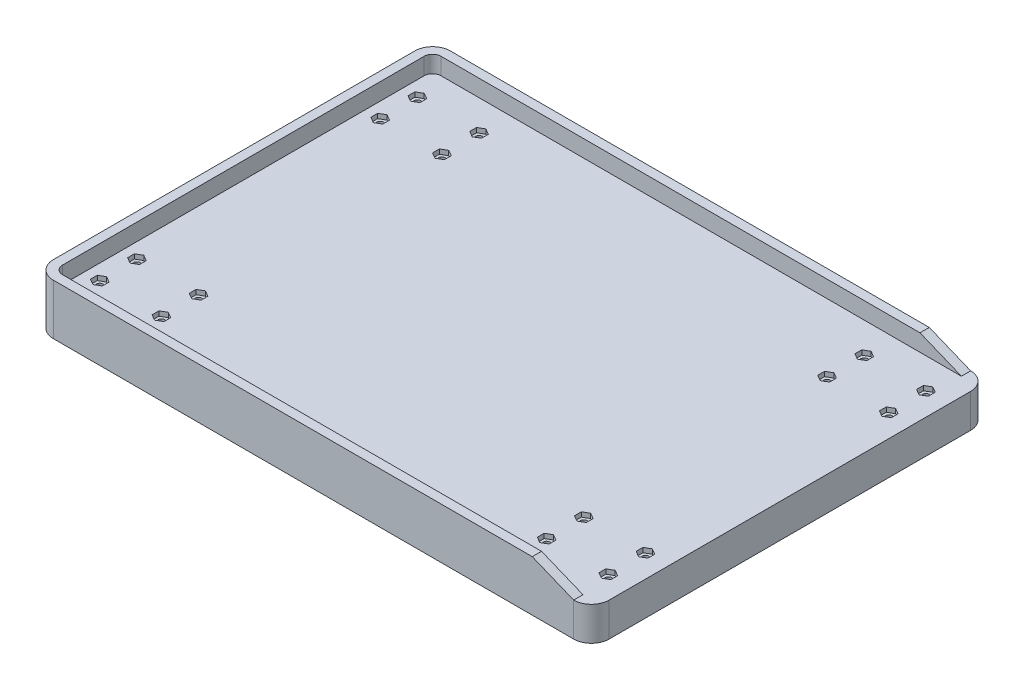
from build123d import *

# Parameters (mm, degrees)
EXTRUDE_1_DEPTH     = 60
CUT_EXTRUDE_1_DEPTH = 20
CUT_EXTRUDE_2_DEPTH = 300
CUT_EXTRUDE_3_DEPTH = 5.5
SKETCH_7_R          = 4
CUT_EXTRUDE_4_DEPTH = 40
SKETCH_8_R          = 2
EXTRUDE_2_DEPTH     = 0.1


with BuildPart() as part:
    # Sketch 1 → Extrude 1 (new body)
    with BuildSketch(Plane(origin=(0, 0, 0), x_dir=(1, 0, 0), z_dir=(0, 1, 0))):
        with BuildLine():
            Line((-308, 235), (308, 235))
            ThreePointArc((308, 235), (322.849242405, 228.849242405), (329, 214))
            Line((329, 214), (329, -214))
            ThreePointArc((329, -214), (322.849242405, -228.849242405), (308, -235))
            Line((308, -235), (-308, -235))
            ThreePointArc((-308, -235), (-322.849242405, -228.849242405), (-329, -214))
            Line((-329, -214), (-329, 214))
            ThreePointArc((-329, 214), (-322.849242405, 228.849242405), (-308, 235))
        make_face()
    extrude(amount=EXTRUDE_1_DEPTH)

    # Sketch 2 → Cut-Extrude 1 (cut)
    with BuildSketch(Plane(origin=(0, 60, 0), x_dir=(1, 0, 0), z_dir=(0, 1, 0))):
        with BuildLine():
            Line((308, 224), (352.266350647, 224))
            Line((352.266350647, 224), (352.266350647, -224))
            Line((352.266350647, -224), (308, -224))
            Line((308, -224), (-308, -224))
            ThreePointArc((-308, -224), (-315.071067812, -221.071067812), (-318, -214))
            Line((-318, -214), (-318, 214))
            ThreePointArc((-318, 214), (-315.071067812, 221.071067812), (-308, 224))
            Line((-308, 224), (308, 224))
        make_face()
    extrude(amount=-CUT_EXTRUDE_1_DEPTH, mode=Mode.SUBTRACT)

    # Sketch 3 → Cut-Extrude 2 (cut, symmetric)
    with BuildSketch(Plane.XY):
        Polygon((308, 40), (259, 60), (259, 75.403351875), (362.157388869, 75.403351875), (362.157388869, 40), align=None)
    extrude(amount=CUT_EXTRUDE_2_DEPTH, both=True, mode=Mode.SUBTRACT)

    # Sketch 6 → Cut-Extrude 3 (cut)
    with BuildSketch(Plane(origin=(0, 40, 0), x_dir=(1, 0, 0), z_dir=(0, 1, 0))):
        Polygon((309, 148.041451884), (302, 152.082903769), (295, 148.041451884), (295, 139.958548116), (302, 135.917096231), (309, 139.958548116), align=None)
        Polygon((309, 183.958548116), (309, 192.041451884), (302, 196.082903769), (295, 192.041451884), (295, 183.958548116), (302, 179.917096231), align=None)
        Polygon((236, 148.041451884), (229, 152.082903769), (222, 148.041451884), (222, 139.958548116), (229, 135.917096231), (236, 139.958548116), align=None)
        Polygon((236, 192.041451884), (229, 196.082903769), (222, 192.041451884), (222, 183.958548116), (229, 179.917096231), (236, 183.958548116), align=None)
        Polygon((-220, 192.041451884), (-227, 196.082903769), (-234, 192.041451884), (-234, 183.958548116), (-227, 179.917096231), (-220, 183.958548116), align=None)
        Polygon((-293, 192.041451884), (-300, 196.082903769), (-307, 192.041451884), (-307, 183.958548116), (-300, 179.917096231), (-293, 183.958548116), align=None)
        Polygon((-293, 148.041451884), (-300, 152.082903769), (-307, 148.041451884), (-307, 139.958548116), (-300, 135.917096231), (-293, 139.958548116), align=None)
        Polygon((-220, 148.041451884), (-227, 152.082903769), (-234, 148.041451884), (-234, 139.958548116), (-227, 135.917096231), (-220, 139.958548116), align=None)
        Polygon((-293, -139.958548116), (-300, -135.917096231), (-307, -139.958548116), (-307, -148.041451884), (-300, -152.082903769), (-293, -148.041451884), align=None)
        Polygon((-220, -139.958548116), (-227, -135.917096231), (-234, -139.958548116), (-234, -148.041451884), (-227, -152.082903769), (-220, -148.041451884), align=None)
        Polygon((-293, -183.958548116), (-300, -179.917096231), (-307, -183.958548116), (-307, -192.041451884), (-300, -196.082903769), (-293, -192.041451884), align=None)
        Polygon((-220, -183.958548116), (-227, -179.917096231), (-234, -183.958548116), (-234, -192.041451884), (-227, -196.082903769), (-220, -192.041451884), align=None)
        Polygon((236, -139.958548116), (229, -135.917096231), (222, -139.958548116), (222, -148.041451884), (229, -152.082903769), (236, -148.041451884), align=None)
        Polygon((236, -183.958548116), (229, -179.917096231), (222, -183.958548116), (222, -192.041451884), (229, -196.082903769), (236, -192.041451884), align=None)
        Polygon((309, -139.958548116), (302, -135.917096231), (295, -139.958548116), (295, -148.041451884), (302, -152.082903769), (309, -148.041451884), align=None)
        Polygon((309, -183.958548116), (302, -179.917096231), (295, -183.958548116), (295, -192.041451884), (302, -196.082903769), (309, -192.041451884), align=None)
    extrude(amount=-CUT_EXTRUDE_3_DEPTH, mode=Mode.SUBTRACT)

    # Sketch 7 → Cut-Extrude 4 (cut)
    with BuildSketch(Plane(origin=(0, 40, 0), x_dir=(1, 0, 0), z_dir=(0, 1, 0))):
        with Locations(Location((-300, 188, 0), (0, 0, 270))):
            Circle(SKETCH_7_R)
        with Locations(Location((-300, 144, 0), (0, 0, 270))):
            Circle(SKETCH_7_R)
        with Locations(Location((-227, 144, 0), (0, 0, 270))):
            Circle(SKETCH_7_R)
        with Locations(Location((-227, 188, 0), (0, 0, 270))):
            Circle(SKETCH_7_R)
        with Locations(Location((-300, -144, 0), (0, 0, 270))):
            Circle(SKETCH_7_R)
        with Locations(Location((-300, -188, 0), (0, 0, 270))):
            Circle(SKETCH_7_R)
        with Locations(Location((-227, -188, 0), (0, 0, 270))):
            Circle(SKETCH_7_R)
        with Locations(Location((-227, -144, 0), (0, 0, 270))):
            Circle(SKETCH_7_R)
        with Locations(Location((229, -144, 0), (0, 0, 270))):
            Circle(SKETCH_7_R)
        with Locations(Location((229, -188, 0), (0, 0, 270))):
            Circle(SKETCH_7_R)
        with Locations(Location((302, -188, 0), (0, 0, 270))):
            Circle(SKETCH_7_R)
        with Locations(Location((302, -144, 0), (0, 0, 270))):
            Circle(SKETCH_7_R)
        with Locations(Location((229, 188, 0), (0, 0, 270))):
            Circle(SKETCH_7_R)
        with Locations(Location((229, 144, 0), (0, 0, 270))):
            Circle(SKETCH_7_R)
        with Locations(Location((302, 144, 0), (0, 0, 270))):
            Circle(SKETCH_7_R)
        with Locations(Location((302, 188, 0), (0, 0, 270))):
            Circle(SKETCH_7_R)
    extrude(amount=-CUT_EXTRUDE_4_DEPTH, mode=Mode.SUBTRACT)

    # Sketch 8 → Extrude 2 (add)
    with BuildSketch(Plane.XZ):
        with Locations(Location((-263.5, 166, 0), (0, 0, 90))):
            Circle(SKETCH_8_R)
        with Locations(Location((-263.5, -166, 0), (0, 0, 90))):
            Circle(SKETCH_8_R)
        with Locations(Location((265.5, -166, 0), (0, 0, 90))):
            Circle(SKETCH_8_R)
        with Locations(Location((265.5, 166, 0), (0, 0, 90))):
            Circle(SKETCH_8_R)
    extrude(amount=EXTRUDE_2_DEPTH)


solid = part.part
